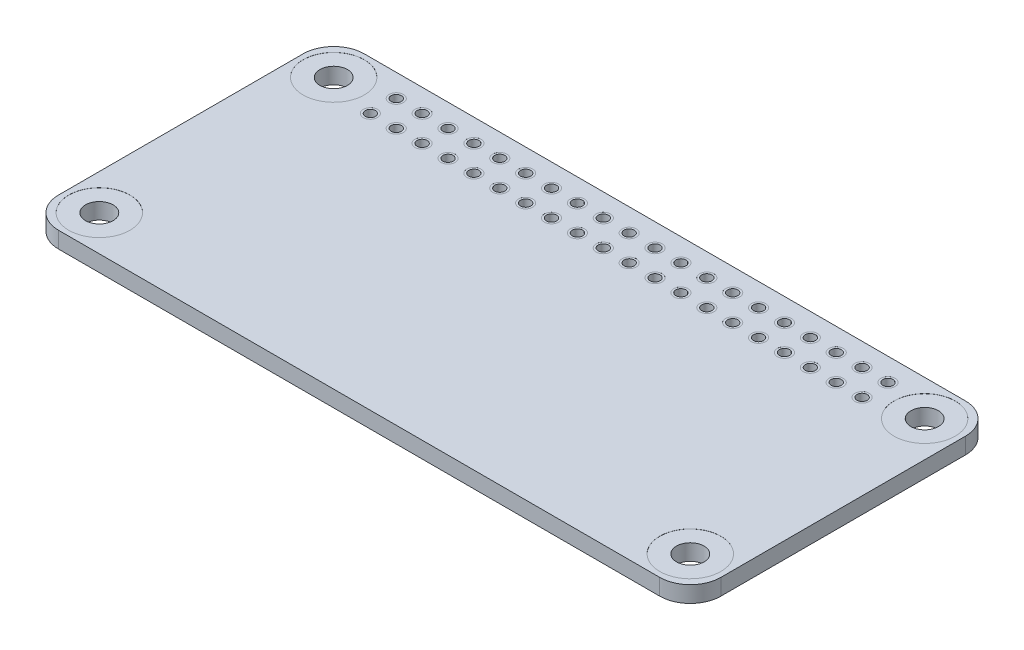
from build123d import *

# Parameters (mm, degrees)
BASES_W                          = 65
BASES_H                          = 30
BASE_DEPTH                       = 0.8
M2_5_CLEARANCE_HOLE_D            = 2.7
FASTENERAREA_START               = -0.01
FASTENERAREAS_R                  = 3
FASTENERAREAS_R_2                = 1.35
FASTENERAREA_DEPTH               = 0.01
F_1_0_1_DIAMETER_HOLE_IO_D       = 1
SOLDERCONNECTIONCUT_START        = -0.001
SOLDERCONNECTIONCUTS_R           = 0.7
SOLDERCONNECTIONCUTS_R_2         = 0.5
SOLDERCONNECTIONCUT_DEPTH        = 0.001
LP_DIAHOLE_IO_COUNT              = 20
LP_DIAHOLE_IO_PITCH              = 2.54
LP_DIAHOLE_IO_COUNT_DIR2         = 2
LP_DIAHOLE_IO_PITCH_DIR2         = 2.54
LP_START                         = -0.001
LP_DIAHOLE_IO_COPY_1_SKETCH_R    = 0.7
LP_DIAHOLE_IO_COPY_1_SKETCH_R_2  = 0.5
LP_DIAHOLE_IO_COPY_1_DEPTH       = 0.001
LP_DIAHOLE_IO_COPY_2_SKETCH_R    = 0.7
LP_DIAHOLE_IO_COPY_2_SKETCH_R_2  = 0.5
LP_DIAHOLE_IO_COPY_2_DEPTH       = 0.001
LP_DIAHOLE_IO_COPY_3_SKETCH_R    = 0.7
LP_DIAHOLE_IO_COPY_3_SKETCH_R_2  = 0.5
LP_DIAHOLE_IO_COPY_3_DEPTH       = 0.001
LP_DIAHOLE_IO_COPY_4_SKETCH_R    = 0.7
LP_DIAHOLE_IO_COPY_4_SKETCH_R_2  = 0.5
LP_DIAHOLE_IO_COPY_4_DEPTH       = 0.001
LP_DIAHOLE_IO_COPY_5_SKETCH_R    = 0.7
LP_DIAHOLE_IO_COPY_5_SKETCH_R_2  = 0.5
LP_DIAHOLE_IO_COPY_5_DEPTH       = 0.001
LP_DIAHOLE_IO_COPY_6_SKETCH_R    = 0.7
LP_DIAHOLE_IO_COPY_6_SKETCH_R_2  = 0.5
LP_DIAHOLE_IO_COPY_6_DEPTH       = 0.001
LP_DIAHOLE_IO_COPY_7_SKETCH_R    = 0.7
LP_DIAHOLE_IO_COPY_7_SKETCH_R_2  = 0.5
LP_DIAHOLE_IO_COPY_7_DEPTH       = 0.001
LP_DIAHOLE_IO_COPY_8_SKETCH_R    = 0.7
LP_DIAHOLE_IO_COPY_8_SKETCH_R_2  = 0.5
LP_DIAHOLE_IO_COPY_8_DEPTH       = 0.001
LP_DIAHOLE_IO_COPY_9_SKETCH_R    = 0.7
LP_DIAHOLE_IO_COPY_9_SKETCH_R_2  = 0.5
LP_DIAHOLE_IO_COPY_9_DEPTH       = 0.001
LP_DIAHOLE_IO_COPY_10_SKETCH_R   = 0.7
LP_DIAHOLE_IO_COPY_10_SKETCH_R_2 = 0.5
LP_DIAHOLE_IO_COPY_10_DEPTH      = 0.001
LP_DIAHOLE_IO_COPY_11_SKETCH_R   = 0.7
LP_DIAHOLE_IO_COPY_11_SKETCH_R_2 = 0.5
LP_DIAHOLE_IO_COPY_11_DEPTH      = 0.001
LP_DIAHOLE_IO_COPY_12_SKETCH_R   = 0.7
LP_DIAHOLE_IO_COPY_12_SKETCH_R_2 = 0.5
LP_DIAHOLE_IO_COPY_12_DEPTH      = 0.001
LP_DIAHOLE_IO_COPY_13_SKETCH_R   = 0.7
LP_DIAHOLE_IO_COPY_13_SKETCH_R_2 = 0.5
LP_DIAHOLE_IO_COPY_13_DEPTH      = 0.001
LP_DIAHOLE_IO_COPY_14_SKETCH_R   = 0.7
LP_DIAHOLE_IO_COPY_14_SKETCH_R_2 = 0.5
LP_DIAHOLE_IO_COPY_14_DEPTH      = 0.001
LP_DIAHOLE_IO_COPY_15_SKETCH_R   = 0.7
LP_DIAHOLE_IO_COPY_15_SKETCH_R_2 = 0.5
LP_DIAHOLE_IO_COPY_15_DEPTH      = 0.001
LP_DIAHOLE_IO_COPY_16_SKETCH_R   = 0.7
LP_DIAHOLE_IO_COPY_16_SKETCH_R_2 = 0.5
LP_DIAHOLE_IO_COPY_16_DEPTH      = 0.001
LP_DIAHOLE_IO_COPY_17_SKETCH_R   = 0.7
LP_DIAHOLE_IO_COPY_17_SKETCH_R_2 = 0.5
LP_DIAHOLE_IO_COPY_17_DEPTH      = 0.001
LP_DIAHOLE_IO_COPY_18_SKETCH_R   = 0.7
LP_DIAHOLE_IO_COPY_18_SKETCH_R_2 = 0.5
LP_DIAHOLE_IO_COPY_18_DEPTH      = 0.001
LP_DIAHOLE_IO_COPY_19_SKETCH_R   = 0.7
LP_DIAHOLE_IO_COPY_19_SKETCH_R_2 = 0.5
LP_DIAHOLE_IO_COPY_19_DEPTH      = 0.001
LP_DIAHOLE_IO_COPY_20_SKETCH_R   = 0.7
LP_DIAHOLE_IO_COPY_20_SKETCH_R_2 = 0.5
LP_DIAHOLE_IO_COPY_20_DEPTH      = 0.001
LP_DIAHOLE_IO_COPY_21_SKETCH_R   = 0.7
LP_DIAHOLE_IO_COPY_21_SKETCH_R_2 = 0.5
LP_DIAHOLE_IO_COPY_21_DEPTH      = 0.001
LP_DIAHOLE_IO_COPY_22_SKETCH_R   = 0.7
LP_DIAHOLE_IO_COPY_22_SKETCH_R_2 = 0.5
LP_DIAHOLE_IO_COPY_22_DEPTH      = 0.001
LP_DIAHOLE_IO_COPY_23_SKETCH_R   = 0.7
LP_DIAHOLE_IO_COPY_23_SKETCH_R_2 = 0.5
LP_DIAHOLE_IO_COPY_23_DEPTH      = 0.001
LP_DIAHOLE_IO_COPY_24_SKETCH_R   = 0.7
LP_DIAHOLE_IO_COPY_24_SKETCH_R_2 = 0.5
LP_DIAHOLE_IO_COPY_24_DEPTH      = 0.001
LP_DIAHOLE_IO_COPY_25_SKETCH_R   = 0.7
LP_DIAHOLE_IO_COPY_25_SKETCH_R_2 = 0.5
LP_DIAHOLE_IO_COPY_25_DEPTH      = 0.001
LP_DIAHOLE_IO_COPY_26_SKETCH_R   = 0.7
LP_DIAHOLE_IO_COPY_26_SKETCH_R_2 = 0.5
LP_DIAHOLE_IO_COPY_26_DEPTH      = 0.001
LP_DIAHOLE_IO_COPY_27_SKETCH_R   = 0.7
LP_DIAHOLE_IO_COPY_27_SKETCH_R_2 = 0.5
LP_DIAHOLE_IO_COPY_27_DEPTH      = 0.001
LP_DIAHOLE_IO_COPY_28_SKETCH_R   = 0.7
LP_DIAHOLE_IO_COPY_28_SKETCH_R_2 = 0.5
LP_DIAHOLE_IO_COPY_28_DEPTH      = 0.001
LP_DIAHOLE_IO_COPY_29_SKETCH_R   = 0.7
LP_DIAHOLE_IO_COPY_29_SKETCH_R_2 = 0.5
LP_DIAHOLE_IO_COPY_29_DEPTH      = 0.001
LP_DIAHOLE_IO_COPY_30_SKETCH_R   = 0.7
LP_DIAHOLE_IO_COPY_30_SKETCH_R_2 = 0.5
LP_DIAHOLE_IO_COPY_30_DEPTH      = 0.001
LP_DIAHOLE_IO_COPY_31_SKETCH_R   = 0.7
LP_DIAHOLE_IO_COPY_31_SKETCH_R_2 = 0.5
LP_DIAHOLE_IO_COPY_31_DEPTH      = 0.001
LP_DIAHOLE_IO_COPY_32_SKETCH_R   = 0.7
LP_DIAHOLE_IO_COPY_32_SKETCH_R_2 = 0.5
LP_DIAHOLE_IO_COPY_32_DEPTH      = 0.001
LP_DIAHOLE_IO_COPY_33_SKETCH_R   = 0.7
LP_DIAHOLE_IO_COPY_33_SKETCH_R_2 = 0.5
LP_DIAHOLE_IO_COPY_33_DEPTH      = 0.001
LP_DIAHOLE_IO_COPY_34_SKETCH_R   = 0.7
LP_DIAHOLE_IO_COPY_34_SKETCH_R_2 = 0.5
LP_DIAHOLE_IO_COPY_34_DEPTH      = 0.001
LP_DIAHOLE_IO_COPY_35_SKETCH_R   = 0.7
LP_DIAHOLE_IO_COPY_35_SKETCH_R_2 = 0.5
LP_DIAHOLE_IO_COPY_35_DEPTH      = 0.001
LP_DIAHOLE_IO_COPY_36_SKETCH_R   = 0.7
LP_DIAHOLE_IO_COPY_36_SKETCH_R_2 = 0.5
LP_DIAHOLE_IO_COPY_36_DEPTH      = 0.001
LP_DIAHOLE_IO_COPY_37_SKETCH_R   = 0.7
LP_DIAHOLE_IO_COPY_37_SKETCH_R_2 = 0.5
LP_DIAHOLE_IO_COPY_37_DEPTH      = 0.001
LP_DIAHOLE_IO_COPY_38_SKETCH_R   = 0.7
LP_DIAHOLE_IO_COPY_38_SKETCH_R_2 = 0.5
LP_DIAHOLE_IO_COPY_38_DEPTH      = 0.001
LP_DIAHOLE_IO_COPY_39_SKETCH_R   = 0.7
LP_DIAHOLE_IO_COPY_39_SKETCH_R_2 = 0.5
LP_DIAHOLE_IO_COPY_39_DEPTH      = 0.001
CORNERRADIUS_R                   = 3
FCHM_START                       = -0.01
FCHM_COPY_1_SKETCH_R             = 3
FCHM_COPY_1_SKETCH_R_2           = 1.35
FCHM_COPY_1_DEPTH                = 0.01


with BuildPart() as part:
    # BaseS → Base (new, symmetric)
    with BuildSketch(Plane(origin=(0, 0, 0), x_dir=(1, 0, 0), z_dir=(0, 1, 0))):
        Rectangle(BASES_W, BASES_H)
    extrude(amount=BASE_DEPTH, both=True)

    # M2.5 Clearance Hole (through all)
    with Locations(Plane(origin=(0, 0.8, 0), x_dir=(1, 0, 0), z_dir=(0, 1, 0))):
        with Locations((-29, 11.5), (-29, -11.5)):
            m2_5_clearance_hole = Hole(M2_5_CLEARANCE_HOLE_D / 2)

    # FastenerAreaS → FastenerArea (cut)
    # profile 1 of 2: a face of its own
    with BuildSketch(Plane(origin=(0, 0.8, 0), x_dir=(1, 0, 0), z_dir=(0, 1, 0)).offset(FASTENERAREA_START)):
        with Locations(Location((-29, -11.5, 0), (0, 0, 270))):
            Circle(FASTENERAREAS_R)
        with Locations(Location((-29, -11.5, 0), (0, 0, 270))):
            Circle(FASTENERAREAS_R_2, mode=Mode.SUBTRACT)
    # profile 2 of 2: a face of its own
    with BuildSketch(Plane(origin=(0, 0.8, 0), x_dir=(1, 0, 0), z_dir=(0, 1, 0)).offset(FASTENERAREA_START)):
        with Locations(Location((-29, 11.5, 0), (0, 0, 270))):
            Circle(FASTENERAREAS_R)
        with Locations(Location((-29, 11.5, 0), (0, 0, 270))):
            Circle(FASTENERAREAS_R_2, mode=Mode.SUBTRACT)
    fastenerarea = extrude(amount=FASTENERAREA_DEPTH, mode=Mode.SUBTRACT)

    # VM FA: FastenerArea across plane
    add(fastenerarea.mirror(Plane.ZX), mode=Mode.SUBTRACT)

    # 1.0 _1_ Diameter Hole IO (through all)
    with Locations(Plane(origin=(0, 0.8, 0), x_dir=(1, 0, 0), z_dir=(0, 1, 0))):
        with Locations((-24.13, 12.77)):
            f_1_0_1_diameter_hole_io = Hole(F_1_0_1_DIAMETER_HOLE_IO_D / 2)

    # SolderConnectionCutS → SolderConnectionCut (cut)
    with BuildSketch(Plane(origin=(0, 0.8, 0), x_dir=(1, 0, 0), z_dir=(0, 1, 0)).offset(SOLDERCONNECTIONCUT_START)):
        with Locations(Location((-24.13, 12.77, 0), (0, 0, 270))):
            Circle(SOLDERCONNECTIONCUTS_R)
        with Locations(Location((-24.13, 12.77, 0), (0, 0, 270))):
            Circle(SOLDERCONNECTIONCUTS_R_2, mode=Mode.SUBTRACT)
    solderconnectioncut = extrude(amount=SOLDERCONNECTIONCUT_DEPTH, mode=Mode.SUBTRACT)

    # SCCVM: SolderConnectionCut across plane
    add(solderconnectioncut.mirror(Plane.ZX), mode=Mode.SUBTRACT)

    # LP DiaHole IO: 1.0 _1_ Diameter Hole IO, SolderConnectionCut 20 × 2
    with Locations(*[(i * LP_DIAHOLE_IO_PITCH, 0, j * LP_DIAHOLE_IO_PITCH_DIR2) for i in range(LP_DIAHOLE_IO_COUNT) for j in range(LP_DIAHOLE_IO_COUNT_DIR2) if (i, j) != (0, 0)]):
        add(f_1_0_1_diameter_hole_io, mode=Mode.SUBTRACT)
        add(solderconnectioncut, mode=Mode.SUBTRACT)

    # LP DiaHole IO copy 1 sketch → LP DiaHole IO copy 1 (cut)
    with BuildSketch(Plane(origin=(0, -0.8, 2.54), x_dir=(1, 0, 0), z_dir=(0, -1, 0)).offset(LP_START)):
        with Locations((-24.13, -12.77)):
            Circle(LP_DIAHOLE_IO_COPY_1_SKETCH_R)
        with Locations((-24.13, -12.77)):
            Circle(LP_DIAHOLE_IO_COPY_1_SKETCH_R_2, mode=Mode.SUBTRACT)
    extrude(amount=LP_DIAHOLE_IO_COPY_1_DEPTH, mode=Mode.SUBTRACT)

    # LP DiaHole IO copy 2 sketch → LP DiaHole IO copy 2 (cut)
    with BuildSketch(Plane(origin=(2.54, -0.8, 0), x_dir=(1, 0, 0), z_dir=(0, -1, 0)).offset(LP_START)):
        with Locations((-24.13, -12.77)):
            Circle(LP_DIAHOLE_IO_COPY_2_SKETCH_R)
        with Locations((-24.13, -12.77)):
            Circle(LP_DIAHOLE_IO_COPY_2_SKETCH_R_2, mode=Mode.SUBTRACT)
    extrude(amount=LP_DIAHOLE_IO_COPY_2_DEPTH, mode=Mode.SUBTRACT)

    # LP DiaHole IO copy 3 sketch → LP DiaHole IO copy 3 (cut)
    with BuildSketch(Plane(origin=(2.54, -0.8, 2.54), x_dir=(1, 0, 0), z_dir=(0, -1, 0)).offset(LP_START)):
        with Locations((-24.13, -12.77)):
            Circle(LP_DIAHOLE_IO_COPY_3_SKETCH_R)
        with Locations((-24.13, -12.77)):
            Circle(LP_DIAHOLE_IO_COPY_3_SKETCH_R_2, mode=Mode.SUBTRACT)
    extrude(amount=LP_DIAHOLE_IO_COPY_3_DEPTH, mode=Mode.SUBTRACT)

    # LP DiaHole IO copy 4 sketch → LP DiaHole IO copy 4 (cut)
    with BuildSketch(Plane(origin=(5.08, -0.8, 0), x_dir=(1, 0, 0), z_dir=(0, -1, 0)).offset(LP_START)):
        with Locations((-24.13, -12.77)):
            Circle(LP_DIAHOLE_IO_COPY_4_SKETCH_R)
        with Locations((-24.13, -12.77)):
            Circle(LP_DIAHOLE_IO_COPY_4_SKETCH_R_2, mode=Mode.SUBTRACT)
    extrude(amount=LP_DIAHOLE_IO_COPY_4_DEPTH, mode=Mode.SUBTRACT)

    # LP DiaHole IO copy 5 sketch → LP DiaHole IO copy 5 (cut)
    with BuildSketch(Plane(origin=(5.08, -0.8, 2.54), x_dir=(1, 0, 0), z_dir=(0, -1, 0)).offset(LP_START)):
        with Locations((-24.13, -12.77)):
            Circle(LP_DIAHOLE_IO_COPY_5_SKETCH_R)
        with Locations((-24.13, -12.77)):
            Circle(LP_DIAHOLE_IO_COPY_5_SKETCH_R_2, mode=Mode.SUBTRACT)
    extrude(amount=LP_DIAHOLE_IO_COPY_5_DEPTH, mode=Mode.SUBTRACT)

    # LP DiaHole IO copy 6 sketch → LP DiaHole IO copy 6 (cut)
    with BuildSketch(Plane(origin=(7.62, -0.8, 0), x_dir=(1, 0, 0), z_dir=(0, -1, 0)).offset(LP_START)):
        with Locations((-24.13, -12.77)):
            Circle(LP_DIAHOLE_IO_COPY_6_SKETCH_R)
        with Locations((-24.13, -12.77)):
            Circle(LP_DIAHOLE_IO_COPY_6_SKETCH_R_2, mode=Mode.SUBTRACT)
    extrude(amount=LP_DIAHOLE_IO_COPY_6_DEPTH, mode=Mode.SUBTRACT)

    # LP DiaHole IO copy 7 sketch → LP DiaHole IO copy 7 (cut)
    with BuildSketch(Plane(origin=(7.62, -0.8, 2.54), x_dir=(1, 0, 0), z_dir=(0, -1, 0)).offset(LP_START)):
        with Locations((-24.13, -12.77)):
            Circle(LP_DIAHOLE_IO_COPY_7_SKETCH_R)
        with Locations((-24.13, -12.77)):
            Circle(LP_DIAHOLE_IO_COPY_7_SKETCH_R_2, mode=Mode.SUBTRACT)
    extrude(amount=LP_DIAHOLE_IO_COPY_7_DEPTH, mode=Mode.SUBTRACT)

    # LP DiaHole IO copy 8 sketch → LP DiaHole IO copy 8 (cut)
    with BuildSketch(Plane(origin=(10.16, -0.8, 0), x_dir=(1, 0, 0), z_dir=(0, -1, 0)).offset(LP_START)):
        with Locations((-24.13, -12.77)):
            Circle(LP_DIAHOLE_IO_COPY_8_SKETCH_R)
        with Locations((-24.13, -12.77)):
            Circle(LP_DIAHOLE_IO_COPY_8_SKETCH_R_2, mode=Mode.SUBTRACT)
    extrude(amount=LP_DIAHOLE_IO_COPY_8_DEPTH, mode=Mode.SUBTRACT)

    # LP DiaHole IO copy 9 sketch → LP DiaHole IO copy 9 (cut)
    with BuildSketch(Plane(origin=(10.16, -0.8, 2.54), x_dir=(1, 0, 0), z_dir=(0, -1, 0)).offset(LP_START)):
        with Locations((-24.13, -12.77)):
            Circle(LP_DIAHOLE_IO_COPY_9_SKETCH_R)
        with Locations((-24.13, -12.77)):
            Circle(LP_DIAHOLE_IO_COPY_9_SKETCH_R_2, mode=Mode.SUBTRACT)
    extrude(amount=LP_DIAHOLE_IO_COPY_9_DEPTH, mode=Mode.SUBTRACT)

    # LP DiaHole IO copy 10 sketch → LP DiaHole IO copy 10 (cut)
    with BuildSketch(Plane(origin=(12.7, -0.8, 0), x_dir=(1, 0, 0), z_dir=(0, -1, 0)).offset(LP_START)):
        with Locations((-24.13, -12.77)):
            Circle(LP_DIAHOLE_IO_COPY_10_SKETCH_R)
        with Locations((-24.13, -12.77)):
            Circle(LP_DIAHOLE_IO_COPY_10_SKETCH_R_2, mode=Mode.SUBTRACT)
    extrude(amount=LP_DIAHOLE_IO_COPY_10_DEPTH, mode=Mode.SUBTRACT)

    # LP DiaHole IO copy 11 sketch → LP DiaHole IO copy 11 (cut)
    with BuildSketch(Plane(origin=(12.7, -0.8, 2.54), x_dir=(1, 0, 0), z_dir=(0, -1, 0)).offset(LP_START)):
        with Locations((-24.13, -12.77)):
            Circle(LP_DIAHOLE_IO_COPY_11_SKETCH_R)
        with Locations((-24.13, -12.77)):
            Circle(LP_DIAHOLE_IO_COPY_11_SKETCH_R_2, mode=Mode.SUBTRACT)
    extrude(amount=LP_DIAHOLE_IO_COPY_11_DEPTH, mode=Mode.SUBTRACT)

    # LP DiaHole IO copy 12 sketch → LP DiaHole IO copy 12 (cut)
    with BuildSketch(Plane(origin=(15.24, -0.8, 0), x_dir=(1, 0, 0), z_dir=(0, -1, 0)).offset(LP_START)):
        with Locations((-24.13, -12.77)):
            Circle(LP_DIAHOLE_IO_COPY_12_SKETCH_R)
        with Locations((-24.13, -12.77)):
            Circle(LP_DIAHOLE_IO_COPY_12_SKETCH_R_2, mode=Mode.SUBTRACT)
    extrude(amount=LP_DIAHOLE_IO_COPY_12_DEPTH, mode=Mode.SUBTRACT)

    # LP DiaHole IO copy 13 sketch → LP DiaHole IO copy 13 (cut)
    with BuildSketch(Plane(origin=(15.24, -0.8, 2.54), x_dir=(1, 0, 0), z_dir=(0, -1, 0)).offset(LP_START)):
        with Locations((-24.13, -12.77)):
            Circle(LP_DIAHOLE_IO_COPY_13_SKETCH_R)
        with Locations((-24.13, -12.77)):
            Circle(LP_DIAHOLE_IO_COPY_13_SKETCH_R_2, mode=Mode.SUBTRACT)
    extrude(amount=LP_DIAHOLE_IO_COPY_13_DEPTH, mode=Mode.SUBTRACT)

    # LP DiaHole IO copy 14 sketch → LP DiaHole IO copy 14 (cut)
    with BuildSketch(Plane(origin=(17.78, -0.8, 0), x_dir=(1, 0, 0), z_dir=(0, -1, 0)).offset(LP_START)):
        with Locations((-24.13, -12.77)):
            Circle(LP_DIAHOLE_IO_COPY_14_SKETCH_R)
        with Locations((-24.13, -12.77)):
            Circle(LP_DIAHOLE_IO_COPY_14_SKETCH_R_2, mode=Mode.SUBTRACT)
    extrude(amount=LP_DIAHOLE_IO_COPY_14_DEPTH, mode=Mode.SUBTRACT)

    # LP DiaHole IO copy 15 sketch → LP DiaHole IO copy 15 (cut)
    with BuildSketch(Plane(origin=(17.78, -0.8, 2.54), x_dir=(1, 0, 0), z_dir=(0, -1, 0)).offset(LP_START)):
        with Locations((-24.13, -12.77)):
            Circle(LP_DIAHOLE_IO_COPY_15_SKETCH_R)
        with Locations((-24.13, -12.77)):
            Circle(LP_DIAHOLE_IO_COPY_15_SKETCH_R_2, mode=Mode.SUBTRACT)
    extrude(amount=LP_DIAHOLE_IO_COPY_15_DEPTH, mode=Mode.SUBTRACT)

    # LP DiaHole IO copy 16 sketch → LP DiaHole IO copy 16 (cut)
    with BuildSketch(Plane(origin=(20.32, -0.8, 0), x_dir=(1, 0, 0), z_dir=(0, -1, 0)).offset(LP_START)):
        with Locations((-24.13, -12.77)):
            Circle(LP_DIAHOLE_IO_COPY_16_SKETCH_R)
        with Locations((-24.13, -12.77)):
            Circle(LP_DIAHOLE_IO_COPY_16_SKETCH_R_2, mode=Mode.SUBTRACT)
    extrude(amount=LP_DIAHOLE_IO_COPY_16_DEPTH, mode=Mode.SUBTRACT)

    # LP DiaHole IO copy 17 sketch → LP DiaHole IO copy 17 (cut)
    with BuildSketch(Plane(origin=(20.32, -0.8, 2.54), x_dir=(1, 0, 0), z_dir=(0, -1, 0)).offset(LP_START)):
        with Locations((-24.13, -12.77)):
            Circle(LP_DIAHOLE_IO_COPY_17_SKETCH_R)
        with Locations((-24.13, -12.77)):
            Circle(LP_DIAHOLE_IO_COPY_17_SKETCH_R_2, mode=Mode.SUBTRACT)
    extrude(amount=LP_DIAHOLE_IO_COPY_17_DEPTH, mode=Mode.SUBTRACT)

    # LP DiaHole IO copy 18 sketch → LP DiaHole IO copy 18 (cut)
    with BuildSketch(Plane(origin=(22.86, -0.8, 0), x_dir=(1, 0, 0), z_dir=(0, -1, 0)).offset(LP_START)):
        with Locations((-24.13, -12.77)):
            Circle(LP_DIAHOLE_IO_COPY_18_SKETCH_R)
        with Locations((-24.13, -12.77)):
            Circle(LP_DIAHOLE_IO_COPY_18_SKETCH_R_2, mode=Mode.SUBTRACT)
    extrude(amount=LP_DIAHOLE_IO_COPY_18_DEPTH, mode=Mode.SUBTRACT)

    # LP DiaHole IO copy 19 sketch → LP DiaHole IO copy 19 (cut)
    with BuildSketch(Plane(origin=(22.86, -0.8, 2.54), x_dir=(1, 0, 0), z_dir=(0, -1, 0)).offset(LP_START)):
        with Locations((-24.13, -12.77)):
            Circle(LP_DIAHOLE_IO_COPY_19_SKETCH_R)
        with Locations((-24.13, -12.77)):
            Circle(LP_DIAHOLE_IO_COPY_19_SKETCH_R_2, mode=Mode.SUBTRACT)
    extrude(amount=LP_DIAHOLE_IO_COPY_19_DEPTH, mode=Mode.SUBTRACT)

    # LP DiaHole IO copy 20 sketch → LP DiaHole IO copy 20 (cut)
    with BuildSketch(Plane(origin=(25.4, -0.8, 0), x_dir=(1, 0, 0), z_dir=(0, -1, 0)).offset(LP_START)):
        with Locations((-24.13, -12.77)):
            Circle(LP_DIAHOLE_IO_COPY_20_SKETCH_R)
        with Locations((-24.13, -12.77)):
            Circle(LP_DIAHOLE_IO_COPY_20_SKETCH_R_2, mode=Mode.SUBTRACT)
    extrude(amount=LP_DIAHOLE_IO_COPY_20_DEPTH, mode=Mode.SUBTRACT)

    # LP DiaHole IO copy 21 sketch → LP DiaHole IO copy 21 (cut)
    with BuildSketch(Plane(origin=(25.4, -0.8, 2.54), x_dir=(1, 0, 0), z_dir=(0, -1, 0)).offset(LP_START)):
        with Locations((-24.13, -12.77)):
            Circle(LP_DIAHOLE_IO_COPY_21_SKETCH_R)
        with Locations((-24.13, -12.77)):
            Circle(LP_DIAHOLE_IO_COPY_21_SKETCH_R_2, mode=Mode.SUBTRACT)
    extrude(amount=LP_DIAHOLE_IO_COPY_21_DEPTH, mode=Mode.SUBTRACT)

    # LP DiaHole IO copy 22 sketch → LP DiaHole IO copy 22 (cut)
    with BuildSketch(Plane(origin=(27.94, -0.8, 0), x_dir=(1, 0, 0), z_dir=(0, -1, 0)).offset(LP_START)):
        with Locations((-24.13, -12.77)):
            Circle(LP_DIAHOLE_IO_COPY_22_SKETCH_R)
        with Locations((-24.13, -12.77)):
            Circle(LP_DIAHOLE_IO_COPY_22_SKETCH_R_2, mode=Mode.SUBTRACT)
    extrude(amount=LP_DIAHOLE_IO_COPY_22_DEPTH, mode=Mode.SUBTRACT)

    # LP DiaHole IO copy 23 sketch → LP DiaHole IO copy 23 (cut)
    with BuildSketch(Plane(origin=(27.94, -0.8, 2.54), x_dir=(1, 0, 0), z_dir=(0, -1, 0)).offset(LP_START)):
        with Locations((-24.13, -12.77)):
            Circle(LP_DIAHOLE_IO_COPY_23_SKETCH_R)
        with Locations((-24.13, -12.77)):
            Circle(LP_DIAHOLE_IO_COPY_23_SKETCH_R_2, mode=Mode.SUBTRACT)
    extrude(amount=LP_DIAHOLE_IO_COPY_23_DEPTH, mode=Mode.SUBTRACT)

    # LP DiaHole IO copy 24 sketch → LP DiaHole IO copy 24 (cut)
    with BuildSketch(Plane(origin=(30.48, -0.8, 0), x_dir=(1, 0, 0), z_dir=(0, -1, 0)).offset(LP_START)):
        with Locations((-24.13, -12.77)):
            Circle(LP_DIAHOLE_IO_COPY_24_SKETCH_R)
        with Locations((-24.13, -12.77)):
            Circle(LP_DIAHOLE_IO_COPY_24_SKETCH_R_2, mode=Mode.SUBTRACT)
    extrude(amount=LP_DIAHOLE_IO_COPY_24_DEPTH, mode=Mode.SUBTRACT)

    # LP DiaHole IO copy 25 sketch → LP DiaHole IO copy 25 (cut)
    with BuildSketch(Plane(origin=(30.48, -0.8, 2.54), x_dir=(1, 0, 0), z_dir=(0, -1, 0)).offset(LP_START)):
        with Locations((-24.13, -12.77)):
            Circle(LP_DIAHOLE_IO_COPY_25_SKETCH_R)
        with Locations((-24.13, -12.77)):
            Circle(LP_DIAHOLE_IO_COPY_25_SKETCH_R_2, mode=Mode.SUBTRACT)
    extrude(amount=LP_DIAHOLE_IO_COPY_25_DEPTH, mode=Mode.SUBTRACT)

    # LP DiaHole IO copy 26 sketch → LP DiaHole IO copy 26 (cut)
    with BuildSketch(Plane(origin=(33.02, -0.8, 0), x_dir=(1, 0, 0), z_dir=(0, -1, 0)).offset(LP_START)):
        with Locations((-24.13, -12.77)):
            Circle(LP_DIAHOLE_IO_COPY_26_SKETCH_R)
        with Locations((-24.13, -12.77)):
            Circle(LP_DIAHOLE_IO_COPY_26_SKETCH_R_2, mode=Mode.SUBTRACT)
    extrude(amount=LP_DIAHOLE_IO_COPY_26_DEPTH, mode=Mode.SUBTRACT)

    # LP DiaHole IO copy 27 sketch → LP DiaHole IO copy 27 (cut)
    with BuildSketch(Plane(origin=(33.02, -0.8, 2.54), x_dir=(1, 0, 0), z_dir=(0, -1, 0)).offset(LP_START)):
        with Locations((-24.13, -12.77)):
            Circle(LP_DIAHOLE_IO_COPY_27_SKETCH_R)
        with Locations((-24.13, -12.77)):
            Circle(LP_DIAHOLE_IO_COPY_27_SKETCH_R_2, mode=Mode.SUBTRACT)
    extrude(amount=LP_DIAHOLE_IO_COPY_27_DEPTH, mode=Mode.SUBTRACT)

    # LP DiaHole IO copy 28 sketch → LP DiaHole IO copy 28 (cut)
    with BuildSketch(Plane(origin=(35.56, -0.8, 0), x_dir=(1, 0, 0), z_dir=(0, -1, 0)).offset(LP_START)):
        with Locations((-24.13, -12.77)):
            Circle(LP_DIAHOLE_IO_COPY_28_SKETCH_R)
        with Locations((-24.13, -12.77)):
            Circle(LP_DIAHOLE_IO_COPY_28_SKETCH_R_2, mode=Mode.SUBTRACT)
    extrude(amount=LP_DIAHOLE_IO_COPY_28_DEPTH, mode=Mode.SUBTRACT)

    # LP DiaHole IO copy 29 sketch → LP DiaHole IO copy 29 (cut)
    with BuildSketch(Plane(origin=(35.56, -0.8, 2.54), x_dir=(1, 0, 0), z_dir=(0, -1, 0)).offset(LP_START)):
        with Locations((-24.13, -12.77)):
            Circle(LP_DIAHOLE_IO_COPY_29_SKETCH_R)
        with Locations((-24.13, -12.77)):
            Circle(LP_DIAHOLE_IO_COPY_29_SKETCH_R_2, mode=Mode.SUBTRACT)
    extrude(amount=LP_DIAHOLE_IO_COPY_29_DEPTH, mode=Mode.SUBTRACT)

    # LP DiaHole IO copy 30 sketch → LP DiaHole IO copy 30 (cut)
    with BuildSketch(Plane(origin=(38.1, -0.8, 0), x_dir=(1, 0, 0), z_dir=(0, -1, 0)).offset(LP_START)):
        with Locations((-24.13, -12.77)):
            Circle(LP_DIAHOLE_IO_COPY_30_SKETCH_R)
        with Locations((-24.13, -12.77)):
            Circle(LP_DIAHOLE_IO_COPY_30_SKETCH_R_2, mode=Mode.SUBTRACT)
    extrude(amount=LP_DIAHOLE_IO_COPY_30_DEPTH, mode=Mode.SUBTRACT)

    # LP DiaHole IO copy 31 sketch → LP DiaHole IO copy 31 (cut)
    with BuildSketch(Plane(origin=(38.1, -0.8, 2.54), x_dir=(1, 0, 0), z_dir=(0, -1, 0)).offset(LP_START)):
        with Locations((-24.13, -12.77)):
            Circle(LP_DIAHOLE_IO_COPY_31_SKETCH_R)
        with Locations((-24.13, -12.77)):
            Circle(LP_DIAHOLE_IO_COPY_31_SKETCH_R_2, mode=Mode.SUBTRACT)
    extrude(amount=LP_DIAHOLE_IO_COPY_31_DEPTH, mode=Mode.SUBTRACT)

    # LP DiaHole IO copy 32 sketch → LP DiaHole IO copy 32 (cut)
    with BuildSketch(Plane(origin=(40.64, -0.8, 0), x_dir=(1, 0, 0), z_dir=(0, -1, 0)).offset(LP_START)):
        with Locations((-24.13, -12.77)):
            Circle(LP_DIAHOLE_IO_COPY_32_SKETCH_R)
        with Locations((-24.13, -12.77)):
            Circle(LP_DIAHOLE_IO_COPY_32_SKETCH_R_2, mode=Mode.SUBTRACT)
    extrude(amount=LP_DIAHOLE_IO_COPY_32_DEPTH, mode=Mode.SUBTRACT)

    # LP DiaHole IO copy 33 sketch → LP DiaHole IO copy 33 (cut)
    with BuildSketch(Plane(origin=(40.64, -0.8, 2.54), x_dir=(1, 0, 0), z_dir=(0, -1, 0)).offset(LP_START)):
        with Locations((-24.13, -12.77)):
            Circle(LP_DIAHOLE_IO_COPY_33_SKETCH_R)
        with Locations((-24.13, -12.77)):
            Circle(LP_DIAHOLE_IO_COPY_33_SKETCH_R_2, mode=Mode.SUBTRACT)
    extrude(amount=LP_DIAHOLE_IO_COPY_33_DEPTH, mode=Mode.SUBTRACT)

    # LP DiaHole IO copy 34 sketch → LP DiaHole IO copy 34 (cut)
    with BuildSketch(Plane(origin=(43.18, -0.8, 0), x_dir=(1, 0, 0), z_dir=(0, -1, 0)).offset(LP_START)):
        with Locations((-24.13, -12.77)):
            Circle(LP_DIAHOLE_IO_COPY_34_SKETCH_R)
        with Locations((-24.13, -12.77)):
            Circle(LP_DIAHOLE_IO_COPY_34_SKETCH_R_2, mode=Mode.SUBTRACT)
    extrude(amount=LP_DIAHOLE_IO_COPY_34_DEPTH, mode=Mode.SUBTRACT)

    # LP DiaHole IO copy 35 sketch → LP DiaHole IO copy 35 (cut)
    with BuildSketch(Plane(origin=(43.18, -0.8, 2.54), x_dir=(1, 0, 0), z_dir=(0, -1, 0)).offset(LP_START)):
        with Locations((-24.13, -12.77)):
            Circle(LP_DIAHOLE_IO_COPY_35_SKETCH_R)
        with Locations((-24.13, -12.77)):
            Circle(LP_DIAHOLE_IO_COPY_35_SKETCH_R_2, mode=Mode.SUBTRACT)
    extrude(amount=LP_DIAHOLE_IO_COPY_35_DEPTH, mode=Mode.SUBTRACT)

    # LP DiaHole IO copy 36 sketch → LP DiaHole IO copy 36 (cut)
    with BuildSketch(Plane(origin=(45.72, -0.8, 0), x_dir=(1, 0, 0), z_dir=(0, -1, 0)).offset(LP_START)):
        with Locations((-24.13, -12.77)):
            Circle(LP_DIAHOLE_IO_COPY_36_SKETCH_R)
        with Locations((-24.13, -12.77)):
            Circle(LP_DIAHOLE_IO_COPY_36_SKETCH_R_2, mode=Mode.SUBTRACT)
    extrude(amount=LP_DIAHOLE_IO_COPY_36_DEPTH, mode=Mode.SUBTRACT)

    # LP DiaHole IO copy 37 sketch → LP DiaHole IO copy 37 (cut)
    with BuildSketch(Plane(origin=(45.72, -0.8, 2.54), x_dir=(1, 0, 0), z_dir=(0, -1, 0)).offset(LP_START)):
        with Locations((-24.13, -12.77)):
            Circle(LP_DIAHOLE_IO_COPY_37_SKETCH_R)
        with Locations((-24.13, -12.77)):
            Circle(LP_DIAHOLE_IO_COPY_37_SKETCH_R_2, mode=Mode.SUBTRACT)
    extrude(amount=LP_DIAHOLE_IO_COPY_37_DEPTH, mode=Mode.SUBTRACT)

    # LP DiaHole IO copy 38 sketch → LP DiaHole IO copy 38 (cut)
    with BuildSketch(Plane(origin=(48.26, -0.8, 0), x_dir=(1, 0, 0), z_dir=(0, -1, 0)).offset(LP_START)):
        with Locations((-24.13, -12.77)):
            Circle(LP_DIAHOLE_IO_COPY_38_SKETCH_R)
        with Locations((-24.13, -12.77)):
            Circle(LP_DIAHOLE_IO_COPY_38_SKETCH_R_2, mode=Mode.SUBTRACT)
    extrude(amount=LP_DIAHOLE_IO_COPY_38_DEPTH, mode=Mode.SUBTRACT)

    # LP DiaHole IO copy 39 sketch → LP DiaHole IO copy 39 (cut)
    with BuildSketch(Plane(origin=(48.26, -0.8, 2.54), x_dir=(1, 0, 0), z_dir=(0, -1, 0)).offset(LP_START)):
        with Locations((-24.13, -12.77)):
            Circle(LP_DIAHOLE_IO_COPY_39_SKETCH_R)
        with Locations((-24.13, -12.77)):
            Circle(LP_DIAHOLE_IO_COPY_39_SKETCH_R_2, mode=Mode.SUBTRACT)
    extrude(amount=LP_DIAHOLE_IO_COPY_39_DEPTH, mode=Mode.SUBTRACT)

    # CornerRadius
    cornerradius_edges = [part.edges().sort_by_distance(p)[0] for p in [
        (32.5, 0, 15),
        (-32.5, 0, 15),
        (-32.5, 0, -15),
        (32.5, 0, -15),
    ]]
    fillet(cornerradius_edges, radius=CORNERRADIUS_R)

    # FCHM: M2.5 Clearance Hole, FastenerArea across plane
    add(m2_5_clearance_hole.mirror(Plane(origin=(0, 0, 0), x_dir=(0, 0, 1), z_dir=(1, 0, 0))), mode=Mode.SUBTRACT)
    add(fastenerarea.mirror(Plane(origin=(0, 0, 0), x_dir=(0, 0, 1), z_dir=(1, 0, 0))), mode=Mode.SUBTRACT)

    # FCHM copy 1 sketch → FCHM copy 1 (cut)
    # profile 1 of 2: a face of its own
    with BuildSketch(Plane(origin=(0, -0.8, 0), x_dir=(-1, 0, 0), z_dir=(0, -1, 0)).offset(FCHM_START)):
        with Locations(Location((-29, -11.5, 0), (0, 0, 270))):
            Circle(FCHM_COPY_1_SKETCH_R)
        with Locations(Location((-29, -11.5, 0), (0, 0, 270))):
            Circle(FCHM_COPY_1_SKETCH_R_2, mode=Mode.SUBTRACT)
    # profile 2 of 2: a face of its own
    with BuildSketch(Plane(origin=(0, -0.8, 0), x_dir=(-1, 0, 0), z_dir=(0, -1, 0)).offset(FCHM_START)):
        with Locations(Location((-29, 11.5, 0), (0, 0, 270))):
            Circle(FCHM_COPY_1_SKETCH_R)
        with Locations(Location((-29, 11.5, 0), (0, 0, 270))):
            Circle(FCHM_COPY_1_SKETCH_R_2, mode=Mode.SUBTRACT)
    extrude(amount=FCHM_COPY_1_DEPTH, mode=Mode.SUBTRACT)


solid = part.part
